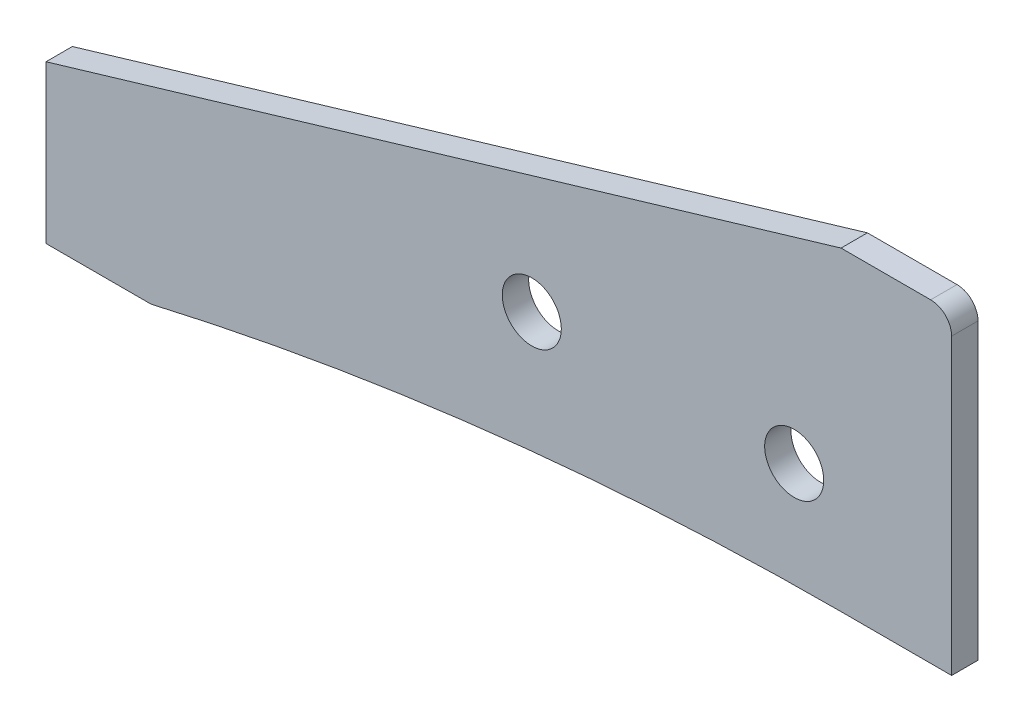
ISO-10303-21;
HEADER;
FILE_DESCRIPTION(('STEP AP214'),'2;1');
FILE_NAME('part.step','',(''),(''),'','','');
FILE_SCHEMA(('AUTOMOTIVE_DESIGN { 1 0 10303 214 1 1 1 1 }'));
ENDSEC;
DATA;
#1=APPLICATION_CONTEXT('core data for automotive mechanical design processes');
#2=APPLICATION_PROTOCOL_DEFINITION('international standard','automotive_design',2000,#1);
#3=PRODUCT_CONTEXT('',#1,'mechanical');
#4=PRODUCT('Part','Part','',(#3));
#5=PRODUCT_RELATED_PRODUCT_CATEGORY('part','',(#4));
#6=PRODUCT_DEFINITION_FORMATION('','',#4);
#7=PRODUCT_DEFINITION_CONTEXT('part definition',#1,'design');
#8=PRODUCT_DEFINITION('design','',#6,#7);
#9=PRODUCT_DEFINITION_SHAPE('','',#8);
#10=(LENGTH_UNIT() NAMED_UNIT(*) SI_UNIT(.MILLI.,.METRE.));
#11=(NAMED_UNIT(*) PLANE_ANGLE_UNIT() SI_UNIT($,.RADIAN.));
#12=(NAMED_UNIT(*) SI_UNIT($,.STERADIAN.) SOLID_ANGLE_UNIT());
#13=UNCERTAINTY_MEASURE_WITH_UNIT(LENGTH_MEASURE(1.E-05),#10,'distance_accuracy_value','');
#14=(GEOMETRIC_REPRESENTATION_CONTEXT(3) GLOBAL_UNCERTAINTY_ASSIGNED_CONTEXT((#13)) GLOBAL_UNIT_ASSIGNED_CONTEXT((#10,
#11,#12)) REPRESENTATION_CONTEXT('',''));
#15=CARTESIAN_POINT('',(0.,0.,0.));
#16=DIRECTION('',(0.,0.,1.));
#17=DIRECTION('',(1.,0.,0.));
#18=AXIS2_PLACEMENT_3D('',#15,#16,#17);
#19=CARTESIAN_POINT('',(-13.3821007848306,0.,-3.19024));
#20=DIRECTION('',(-0.284745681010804,0.958603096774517,0.));
#21=DIRECTION('',(-0.958603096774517,-0.284745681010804,0.));
#22=AXIS2_PLACEMENT_3D('',#19,#20,#21);
#23=PLANE('',#22);
#24=DIRECTION('',(-0.958603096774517,-0.284745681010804,0.));
#25=VECTOR('',#24,1.);
#26=CARTESIAN_POINT('',(-13.3821007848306,0.,0.));
#27=LINE('',#26,#25);
#28=CARTESIAN_POINT('',(-13.3821007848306,0.,0.));
#29=VERTEX_POINT('',#28);
#30=CARTESIAN_POINT('',(-109.58051683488,-28.5750000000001,0.));
#31=VERTEX_POINT('',#30);
#32=EDGE_CURVE('E154',#29,#31,#27,.T.);
#33=ORIENTED_EDGE('',*,*,#32,.F.);
#34=DIRECTION('',(0.,0.,1.));
#35=VECTOR('',#34,1.);
#36=CARTESIAN_POINT('',(-13.3821007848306,0.,-3.19024));
#37=LINE('',#36,#35);
#38=CARTESIAN_POINT('',(-13.3821007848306,0.,-3.19024));
#39=VERTEX_POINT('',#38);
#40=EDGE_CURVE('E11',#39,#29,#37,.T.);
#41=ORIENTED_EDGE('',*,*,#40,.F.);
#42=DIRECTION('',(-0.958603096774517,-0.284745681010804,0.));
#43=VECTOR('',#42,1.);
#44=CARTESIAN_POINT('',(-13.3821007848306,0.,-3.19024));
#45=LINE('',#44,#43);
#46=CARTESIAN_POINT('',(-109.58051683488,-28.5750000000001,-3.19024));
#47=VERTEX_POINT('',#46);
#48=EDGE_CURVE('E180',#39,#47,#45,.T.);
#49=ORIENTED_EDGE('',*,*,#48,.T.);
#50=DIRECTION('',(0.,0.,1.));
#51=VECTOR('',#50,1.);
#52=CARTESIAN_POINT('',(-109.58051683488,-28.5750000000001,-3.19024));
#53=LINE('',#52,#51);
#54=EDGE_CURVE('E47',#47,#31,#53,.T.);
#55=ORIENTED_EDGE('',*,*,#54,.T.);
#56=EDGE_LOOP('',(#33,#41,#49,#55));
#57=FACE_BOUND('',#56,.T.);
#58=ADVANCED_FACE('F44',(#57),#23,.T.);
#59=CARTESIAN_POINT('',(-2.54000000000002,0.,-3.19024));
#60=DIRECTION('',(0.,1.,0.));
#61=DIRECTION('',(-1.,0.,0.));
#62=AXIS2_PLACEMENT_3D('',#59,#60,#61);
#63=PLANE('',#62);
#64=DIRECTION('',(-1.,0.,0.));
#65=VECTOR('',#64,1.);
#66=CARTESIAN_POINT('',(-2.54000000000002,0.,0.));
#67=LINE('',#66,#65);
#68=CARTESIAN_POINT('',(-2.54000000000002,0.,0.));
#69=VERTEX_POINT('',#68);
#70=EDGE_CURVE('E177',#69,#29,#67,.T.);
#71=ORIENTED_EDGE('',*,*,#70,.F.);
#72=DIRECTION('',(0.,0.,1.));
#73=VECTOR('',#72,1.);
#74=CARTESIAN_POINT('',(-2.54000000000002,0.,-3.19024));
#75=LINE('',#74,#73);
#76=CARTESIAN_POINT('',(-2.54000000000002,0.,-3.19024));
#77=VERTEX_POINT('',#76);
#78=EDGE_CURVE('E53',#77,#69,#75,.T.);
#79=ORIENTED_EDGE('',*,*,#78,.F.);
#80=DIRECTION('',(-1.,0.,0.));
#81=VECTOR('',#80,1.);
#82=CARTESIAN_POINT('',(-2.54000000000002,0.,-3.19024));
#83=LINE('',#82,#81);
#84=EDGE_CURVE('E138',#77,#39,#83,.T.);
#85=ORIENTED_EDGE('',*,*,#84,.T.);
#86=ORIENTED_EDGE('',*,*,#40,.T.);
#87=EDGE_LOOP('',(#71,#79,#85,#86));
#88=FACE_BOUND('',#87,.T.);
#89=ADVANCED_FACE('F193',(#88),#63,.T.);
#90=CARTESIAN_POINT('',(-2.54,-2.54,-3.19024));
#91=DIRECTION('',(0.,0.,1.));
#92=DIRECTION('',(1.,0.,0.));
#93=AXIS2_PLACEMENT_3D('',#90,#91,#92);
#94=CYLINDRICAL_SURFACE('',#93,2.54);
#95=CARTESIAN_POINT('',(-2.54,-2.54,0.));
#96=DIRECTION('',(0.,0.,1.));
#97=DIRECTION('',(-1.,0.,0.));
#98=AXIS2_PLACEMENT_3D('',#95,#96,#97);
#99=CIRCLE('',#98,2.54);
#100=CARTESIAN_POINT('',(0.,-2.54000000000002,0.));
#101=VERTEX_POINT('',#100);
#102=EDGE_CURVE('E124',#101,#69,#99,.T.);
#103=ORIENTED_EDGE('',*,*,#102,.F.);
#104=DIRECTION('',(0.,0.,1.));
#105=VECTOR('',#104,1.);
#106=CARTESIAN_POINT('',(0.,-2.54000000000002,-3.19024));
#107=LINE('',#106,#105);
#108=CARTESIAN_POINT('',(0.,-2.54000000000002,-3.19024));
#109=VERTEX_POINT('',#108);
#110=EDGE_CURVE('E119',#109,#101,#107,.T.);
#111=ORIENTED_EDGE('',*,*,#110,.F.);
#112=CARTESIAN_POINT('',(-2.54,-2.54,-3.19024));
#113=DIRECTION('',(0.,0.,1.));
#114=DIRECTION('',(-1.,0.,0.));
#115=AXIS2_PLACEMENT_3D('',#112,#113,#114);
#116=CIRCLE('',#115,2.54);
#117=EDGE_CURVE('E122',#109,#77,#116,.T.);
#118=ORIENTED_EDGE('',*,*,#117,.T.);
#119=ORIENTED_EDGE('',*,*,#78,.T.);
#120=EDGE_LOOP('',(#103,#111,#118,#119));
#121=FACE_BOUND('',#120,.T.);
#122=ADVANCED_FACE('F121',(#121),#94,.T.);
#123=CARTESIAN_POINT('',(0.,-2.54000000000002,-3.19024));
#124=DIRECTION('',(1.,0.,0.));
#125=DIRECTION('',(0.,1.,0.));
#126=AXIS2_PLACEMENT_3D('',#123,#124,#125);
#127=PLANE('',#126);
#128=DIRECTION('',(0.,1.,0.));
#129=VECTOR('',#128,1.);
#130=CARTESIAN_POINT('',(0.,-2.54000000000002,0.));
#131=LINE('',#130,#129);
#132=CARTESIAN_POINT('',(0.,-38.0999999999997,0.));
#133=VERTEX_POINT('',#132);
#134=EDGE_CURVE('E173',#133,#101,#131,.T.);
#135=ORIENTED_EDGE('',*,*,#134,.F.);
#136=DIRECTION('',(0.,0.,1.));
#137=VECTOR('',#136,1.);
#138=CARTESIAN_POINT('',(0.,-38.0999999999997,-3.19024));
#139=LINE('',#138,#137);
#140=CARTESIAN_POINT('',(0.,-38.0999999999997,-3.19024));
#141=VERTEX_POINT('',#140);
#142=EDGE_CURVE('E130',#141,#133,#139,.T.);
#143=ORIENTED_EDGE('',*,*,#142,.F.);
#144=DIRECTION('',(0.,1.,0.));
#145=VECTOR('',#144,1.);
#146=CARTESIAN_POINT('',(0.,-2.54000000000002,-3.19024));
#147=LINE('',#146,#145);
#148=EDGE_CURVE('E136',#141,#109,#147,.T.);
#149=ORIENTED_EDGE('',*,*,#148,.T.);
#150=ORIENTED_EDGE('',*,*,#110,.T.);
#151=EDGE_LOOP('',(#135,#143,#149,#150));
#152=FACE_BOUND('',#151,.T.);
#153=ADVANCED_FACE('F141',(#152),#127,.T.);
#154=CARTESIAN_POINT('',(0.,-38.0999999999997,-3.19024));
#155=DIRECTION('',(0.,-1.,0.));
#156=DIRECTION('',(1.,0.,0.));
#157=AXIS2_PLACEMENT_3D('',#154,#155,#156);
#158=PLANE('',#157);
#159=DIRECTION('',(1.,0.,0.));
#160=VECTOR('',#159,1.);
#161=CARTESIAN_POINT('',(0.,-38.0999999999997,0.));
#162=LINE('',#161,#160);
#163=CARTESIAN_POINT('',(-13.3821007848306,-38.0999999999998,0.));
#164=VERTEX_POINT('',#163);
#165=EDGE_CURVE('E169',#164,#133,#162,.T.);
#166=ORIENTED_EDGE('',*,*,#165,.F.);
#167=DIRECTION('',(0.,0.,1.));
#168=VECTOR('',#167,1.);
#169=CARTESIAN_POINT('',(-13.3821007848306,-38.0999999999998,-3.19024));
#170=LINE('',#169,#168);
#171=CARTESIAN_POINT('',(-13.3821007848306,-38.0999999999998,-3.19024));
#172=VERTEX_POINT('',#171);
#173=EDGE_CURVE('E185',#172,#164,#170,.T.);
#174=ORIENTED_EDGE('',*,*,#173,.F.);
#175=DIRECTION('',(1.,0.,0.));
#176=VECTOR('',#175,1.);
#177=CARTESIAN_POINT('',(0.,-38.0999999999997,-3.19024));
#178=LINE('',#177,#176);
#179=EDGE_CURVE('E143',#172,#141,#178,.T.);
#180=ORIENTED_EDGE('',*,*,#179,.T.);
#181=ORIENTED_EDGE('',*,*,#142,.T.);
#182=EDGE_LOOP('',(#166,#174,#180,#181));
#183=FACE_BOUND('',#182,.T.);
#184=ADVANCED_FACE('F206',(#183),#158,.T.);
#185=CARTESIAN_POINT('',(-13.3821007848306,-408.845989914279,-3.19024));
#186=DIRECTION('',(0.,0.,1.));
#187=DIRECTION('',(1.,0.,0.));
#188=AXIS2_PLACEMENT_3D('',#185,#186,#187);
#189=CYLINDRICAL_SURFACE('',#188,370.745989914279);
#190=CARTESIAN_POINT('',(-13.3821007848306,-408.845989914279,0.));
#191=DIRECTION('',(0.,0.,-1.));
#192=DIRECTION('',(-1.,0.,0.));
#193=AXIS2_PLACEMENT_3D('',#190,#191,#192);
#194=CIRCLE('',#193,370.745989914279);
#195=CARTESIAN_POINT('',(-96.8805168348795,-47.625,0.));
#196=VERTEX_POINT('',#195);
#197=EDGE_CURVE('E165',#196,#164,#194,.T.);
#198=ORIENTED_EDGE('',*,*,#197,.F.);
#199=DIRECTION('',(0.,0.,1.));
#200=VECTOR('',#199,1.);
#201=CARTESIAN_POINT('',(-96.8805168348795,-47.625,-3.19024));
#202=LINE('',#201,#200);
#203=CARTESIAN_POINT('',(-96.8805168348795,-47.625,-3.19024));
#204=VERTEX_POINT('',#203);
#205=EDGE_CURVE('E187',#204,#196,#202,.T.);
#206=ORIENTED_EDGE('',*,*,#205,.F.);
#207=CARTESIAN_POINT('',(-13.3821007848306,-408.845989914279,-3.19024));
#208=DIRECTION('',(0.,0.,-1.));
#209=DIRECTION('',(-1.,0.,0.));
#210=AXIS2_PLACEMENT_3D('',#207,#208,#209);
#211=CIRCLE('',#210,370.745989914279);
#212=EDGE_CURVE('E148',#204,#172,#211,.T.);
#213=ORIENTED_EDGE('',*,*,#212,.T.);
#214=ORIENTED_EDGE('',*,*,#173,.T.);
#215=EDGE_LOOP('',(#198,#206,#213,#214));
#216=FACE_BOUND('',#215,.T.);
#217=ADVANCED_FACE('F209',(#216),#189,.F.);
#218=CARTESIAN_POINT('',(-109.58051683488,-47.6250000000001,-3.19024));
#219=DIRECTION('',(0.,-1.,0.));
#220=DIRECTION('',(1.,0.,0.));
#221=AXIS2_PLACEMENT_3D('',#218,#219,#220);
#222=PLANE('',#221);
#223=DIRECTION('',(1.,0.,0.));
#224=VECTOR('',#223,1.);
#225=CARTESIAN_POINT('',(-109.58051683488,-47.6250000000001,0.));
#226=LINE('',#225,#224);
#227=CARTESIAN_POINT('',(-109.58051683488,-47.6250000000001,0.));
#228=VERTEX_POINT('',#227);
#229=EDGE_CURVE('E162',#228,#196,#226,.T.);
#230=ORIENTED_EDGE('',*,*,#229,.F.);
#231=DIRECTION('',(0.,0.,1.));
#232=VECTOR('',#231,1.);
#233=CARTESIAN_POINT('',(-109.58051683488,-47.6250000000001,-3.19024));
#234=LINE('',#233,#232);
#235=CARTESIAN_POINT('',(-109.58051683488,-47.6250000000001,-3.19024));
#236=VERTEX_POINT('',#235);
#237=EDGE_CURVE('E188',#236,#228,#234,.T.);
#238=ORIENTED_EDGE('',*,*,#237,.F.);
#239=DIRECTION('',(1.,0.,0.));
#240=VECTOR('',#239,1.);
#241=CARTESIAN_POINT('',(-109.58051683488,-47.6250000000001,-3.19024));
#242=LINE('',#241,#240);
#243=EDGE_CURVE('E261',#236,#204,#242,.T.);
#244=ORIENTED_EDGE('',*,*,#243,.T.);
#245=ORIENTED_EDGE('',*,*,#205,.T.);
#246=EDGE_LOOP('',(#230,#238,#244,#245));
#247=FACE_BOUND('',#246,.T.);
#248=ADVANCED_FACE('F213',(#247),#222,.T.);
#249=CARTESIAN_POINT('',(-109.58051683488,-28.5750000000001,-3.19024));
#250=DIRECTION('',(-1.,0.,0.));
#251=DIRECTION('',(0.,0.,1.));
#252=AXIS2_PLACEMENT_3D('',#249,#250,#251);
#253=PLANE('',#252);
#254=DIRECTION('',(0.,-1.,0.));
#255=VECTOR('',#254,1.);
#256=CARTESIAN_POINT('',(-109.58051683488,-28.5750000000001,0.));
#257=LINE('',#256,#255);
#258=EDGE_CURVE('E158',#31,#228,#257,.T.);
#259=ORIENTED_EDGE('',*,*,#258,.F.);
#260=ORIENTED_EDGE('',*,*,#54,.F.);
#261=DIRECTION('',(0.,-1.,0.));
#262=VECTOR('',#261,1.);
#263=CARTESIAN_POINT('',(-109.58051683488,-28.5750000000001,-3.19024));
#264=LINE('',#263,#262);
#265=EDGE_CURVE('E259',#47,#236,#264,.T.);
#266=ORIENTED_EDGE('',*,*,#265,.T.);
#267=ORIENTED_EDGE('',*,*,#237,.T.);
#268=EDGE_LOOP('',(#259,#260,#266,#267));
#269=FACE_BOUND('',#268,.T.);
#270=ADVANCED_FACE('F190',(#269),#253,.T.);
#271=CARTESIAN_POINT('',(-13.3821007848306,-408.845989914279,-3.19024));
#272=DIRECTION('',(0.,0.,-1.));
#273=DIRECTION('',(-1.,0.,0.));
#274=AXIS2_PLACEMENT_3D('',#271,#272,#273);
#275=PLANE('',#274);
#276=CARTESIAN_POINT('',(-19.0500000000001,-25.3999999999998,-3.19024));
#277=DIRECTION('',(0.,0.,-1.));
#278=DIRECTION('',(-1.,0.,0.));
#279=AXIS2_PLACEMENT_3D('',#276,#277,#278);
#280=CIRCLE('',#279,3.571875);
#281=CARTESIAN_POINT('',(-22.6218750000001,-25.3999999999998,-3.19024));
#282=VERTEX_POINT('',#281);
#283=EDGE_CURVE('E243',#282,#282,#280,.T.);
#284=ORIENTED_EDGE('',*,*,#283,.F.);
#285=EDGE_LOOP('',(#284));
#286=FACE_BOUND('',#285,.T.);
#287=CARTESIAN_POINT('',(-50.8000000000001,-25.3999999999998,-3.19024));
#288=DIRECTION('',(0.,0.,-1.));
#289=DIRECTION('',(-1.,0.,0.));
#290=AXIS2_PLACEMENT_3D('',#287,#288,#289);
#291=CIRCLE('',#290,3.571875);
#292=CARTESIAN_POINT('',(-54.3718750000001,-25.3999999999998,-3.19024));
#293=VERTEX_POINT('',#292);
#294=EDGE_CURVE('E159',#293,#293,#291,.T.);
#295=ORIENTED_EDGE('',*,*,#294,.F.);
#296=EDGE_LOOP('',(#295));
#297=FACE_BOUND('',#296,.T.);
#298=ORIENTED_EDGE('',*,*,#48,.F.);
#299=ORIENTED_EDGE('',*,*,#84,.F.);
#300=ORIENTED_EDGE('',*,*,#117,.F.);
#301=ORIENTED_EDGE('',*,*,#148,.F.);
#302=ORIENTED_EDGE('',*,*,#179,.F.);
#303=ORIENTED_EDGE('',*,*,#212,.F.);
#304=ORIENTED_EDGE('',*,*,#243,.F.);
#305=ORIENTED_EDGE('',*,*,#265,.F.);
#306=EDGE_LOOP('',(#298,#299,#300,#301,#302,#303,#304,#305));
#307=FACE_BOUND('',#306,.T.);
#308=ADVANCED_FACE('F134',(#286,#297,#307),#275,.T.);
#309=CARTESIAN_POINT('',(-13.3821007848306,-408.845989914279,0.));
#310=DIRECTION('',(0.,0.,-1.));
#311=DIRECTION('',(-1.,0.,0.));
#312=AXIS2_PLACEMENT_3D('',#309,#310,#311);
#313=PLANE('',#312);
#314=CARTESIAN_POINT('',(-19.0500000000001,-25.3999999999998,0.));
#315=DIRECTION('',(0.,0.,1.));
#316=DIRECTION('',(1.,0.,0.));
#317=AXIS2_PLACEMENT_3D('',#314,#315,#316);
#318=CIRCLE('',#317,3.571875);
#319=CARTESIAN_POINT('',(-15.4781250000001,-25.3999999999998,0.));
#320=VERTEX_POINT('',#319);
#321=EDGE_CURVE('E241',#320,#320,#318,.T.);
#322=ORIENTED_EDGE('',*,*,#321,.F.);
#323=EDGE_LOOP('',(#322));
#324=FACE_BOUND('',#323,.T.);
#325=CARTESIAN_POINT('',(-50.8000000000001,-25.3999999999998,0.));
#326=DIRECTION('',(0.,0.,1.));
#327=DIRECTION('',(1.,0.,0.));
#328=AXIS2_PLACEMENT_3D('',#325,#326,#327);
#329=CIRCLE('',#328,3.571875);
#330=CARTESIAN_POINT('',(-47.2281250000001,-25.3999999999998,0.));
#331=VERTEX_POINT('',#330);
#332=EDGE_CURVE('E245',#331,#331,#329,.T.);
#333=ORIENTED_EDGE('',*,*,#332,.F.);
#334=EDGE_LOOP('',(#333));
#335=FACE_BOUND('',#334,.T.);
#336=ORIENTED_EDGE('',*,*,#32,.T.);
#337=ORIENTED_EDGE('',*,*,#258,.T.);
#338=ORIENTED_EDGE('',*,*,#229,.T.);
#339=ORIENTED_EDGE('',*,*,#197,.T.);
#340=ORIENTED_EDGE('',*,*,#165,.T.);
#341=ORIENTED_EDGE('',*,*,#134,.T.);
#342=ORIENTED_EDGE('',*,*,#102,.T.);
#343=ORIENTED_EDGE('',*,*,#70,.T.);
#344=EDGE_LOOP('',(#336,#337,#338,#339,#340,#341,#342,#343));
#345=FACE_BOUND('',#344,.T.);
#346=ADVANCED_FACE('F192',(#324,#335,#345),#313,.F.);
#347=CARTESIAN_POINT('',(-50.8000000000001,-25.3999999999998,0.));
#348=DIRECTION('',(0.,0.,1.));
#349=DIRECTION('',(1.,0.,0.));
#350=AXIS2_PLACEMENT_3D('',#347,#348,#349);
#351=CYLINDRICAL_SURFACE('',#350,3.571875);
#352=ORIENTED_EDGE('',*,*,#332,.T.);
#353=EDGE_LOOP('',(#352));
#354=FACE_BOUND('',#353,.T.);
#355=ORIENTED_EDGE('',*,*,#294,.T.);
#356=EDGE_LOOP('',(#355));
#357=FACE_BOUND('',#356,.T.);
#358=ADVANCED_FACE('F225',(#354,#357),#351,.F.);
#359=CARTESIAN_POINT('',(-19.0500000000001,-25.3999999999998,0.));
#360=DIRECTION('',(0.,0.,1.));
#361=DIRECTION('',(1.,0.,0.));
#362=AXIS2_PLACEMENT_3D('',#359,#360,#361);
#363=CYLINDRICAL_SURFACE('',#362,3.571875);
#364=ORIENTED_EDGE('',*,*,#321,.T.);
#365=EDGE_LOOP('',(#364));
#366=FACE_BOUND('',#365,.T.);
#367=ORIENTED_EDGE('',*,*,#283,.T.);
#368=EDGE_LOOP('',(#367));
#369=FACE_BOUND('',#368,.T.);
#370=ADVANCED_FACE('F232',(#366,#369),#363,.F.);
#371=CLOSED_SHELL('',(#58,#89,#122,#153,#184,#217,#248,#270,#308,#346,#358,#370));
#372=MANIFOLD_SOLID_BREP('B2',#371);
#373=ADVANCED_BREP_SHAPE_REPRESENTATION('',(#18,#372),#14);
#374=SHAPE_DEFINITION_REPRESENTATION(#9,#373);
ENDSEC;
END-ISO-10303-21;
